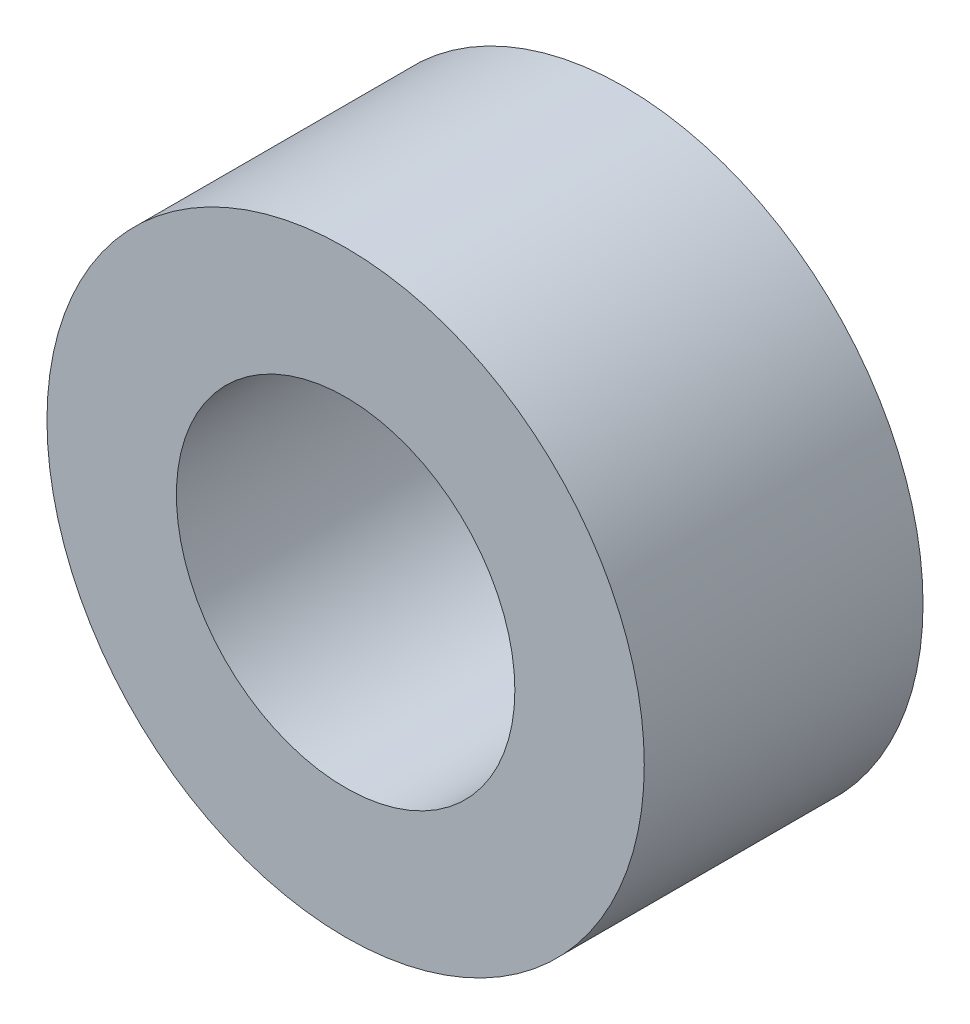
from build123d import *

# Parameters (mm, degrees)
SKETCH_1_R      = 3
SKETCH_1_R_2    = 1.7
EXTRUDE_1_DEPTH = 2.8


with BuildPart() as part:
    # Sketch 1 → Extrude 1 (new body)
    with BuildSketch(Plane.XY):
        Circle(SKETCH_1_R)
        Circle(SKETCH_1_R_2, mode=Mode.SUBTRACT)
    extrude(amount=EXTRUDE_1_DEPTH)


solid = part.part
